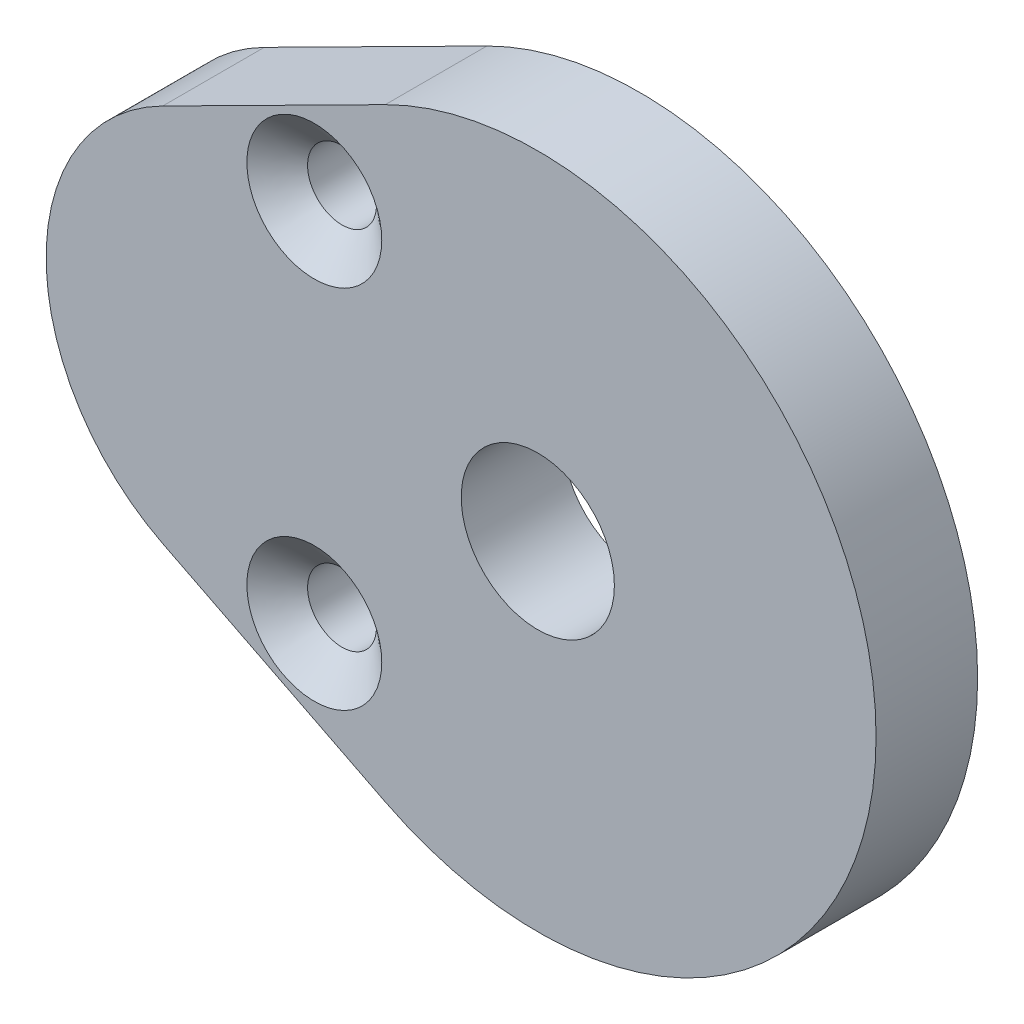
from build123d import *

# Parameters (mm, degrees)
BOSS_EXTRUDE1_DEPTH                               = 6.35
SKETCH3_R                                         = 4.7879
CUT_EXTRUDE1_DEPTH                                = 38.842217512
CSK_FOR_8_FLAT_HEAD_MACHINE_SCREW_100_D           = 4.3053
CSK_FOR_8_FLAT_HEAD_MACHINE_SCREW_100_CSINK_D     = 8.4328
CSK_FOR_8_FLAT_HEAD_MACHINE_SCREW_100_CSINK_ANGLE = 100


with BuildPart() as part:
    # Sketch2 → Boss-Extrude1 (new body)
    with BuildSketch(Plane.XY):
        with BuildLine():
            Line((-23.44674, -11.84574117), (-9.534698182, -18.87383641))
            ThreePointArc((-9.534698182, -18.87383641), (21.1455, 0), (-9.534698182, 18.87383641))
            Line((-9.534698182, 18.87383641), (-23.44674, 11.84574117))
            ThreePointArc((-23.44674, 11.84574117), (-30.734, 0), (-23.44674, -11.84574117))
        make_face()
    extrude(amount=BOSS_EXTRUDE1_DEPTH)

    # Sketch3 → Cut-Extrude1 (cut, through all)
    with BuildSketch(Plane.XY.offset(6.35)):
        Circle(SKETCH3_R)
    extrude(amount=-CUT_EXTRUDE1_DEPTH, mode=Mode.SUBTRACT)

    # CSK for _8 Flat Head Machine Screw _100 (through all)
    with Locations(Plane.XY.offset(6.35)):
        with Locations((-13.97, 11.43), (-13.97, -11.43)):
            CounterSinkHole(CSK_FOR_8_FLAT_HEAD_MACHINE_SCREW_100_D / 2, CSK_FOR_8_FLAT_HEAD_MACHINE_SCREW_100_CSINK_D / 2, counter_sink_angle=CSK_FOR_8_FLAT_HEAD_MACHINE_SCREW_100_CSINK_ANGLE)


solid = part.part
